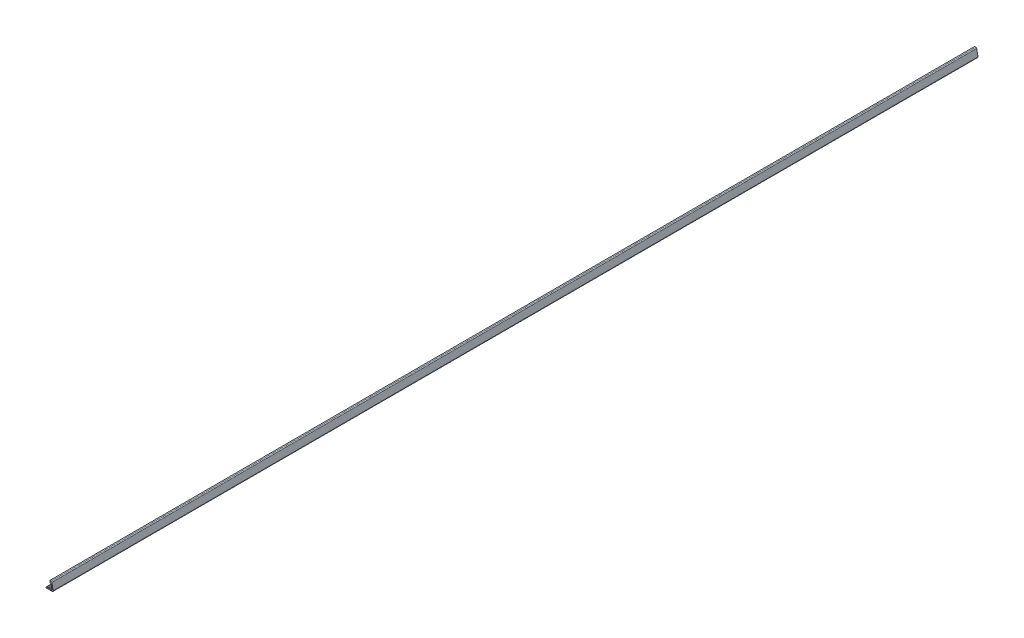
from build123d import *

# Parameters (mm, degrees)
EXTRUDE_1_DEPTH = 1000


with BuildPart() as part:
    # Sketch 2 → Extrude 1 (new body)
    with BuildSketch(Plane.XY):
        with BuildLine():
            Line((3.105809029, 0), (-3.105809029, 0))
            ThreePointArc((-3.105809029, 0), (-3.45936242, 0.146446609), (-3.605809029, 0.5))
            Line((-3.605809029, 0.5), (-3.605809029, 0.548508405))
            ThreePointArc((-3.605809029, 0.548508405), (-3.567748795, 0.739850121), (-3.45936242, 0.902061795))
            Line((-3.45936242, 0.902061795), (-2.561424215, 1.8))
            Line((-2.561424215, 1.8), (-2.361424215, 1))
            Line((-2.361424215, 1), (-1.561424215, 1.8))
            Line((-1.561424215, 1.8), (-1.361424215, 1))
            Line((-1.361424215, 1), (-0.561424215, 1.8))
            Line((-0.561424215, 1.8), (-0.361424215, 1))
            Line((-0.361424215, 1), (0.438575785, 1.8))
            Line((0.438575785, 1.8), (0.638575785, 1))
            Line((0.638575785, 1), (1.438575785, 1.8))
            Line((1.438575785, 1.8), (1.638575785, 1))
            Line((1.638575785, 1), (2.298416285, 1))
            ThreePointArc((2.298416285, 1), (2.683663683, 1.181276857), (2.789565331, 1.593662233))
            Line((2.789565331, 1.593662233), (1.908394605, 6.214373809))
            ThreePointArc((1.908394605, 6.214373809), (1.732145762, 6.491910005), (1.421651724, 6.6))
            Line((1.421651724, 6.6), (0.696296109, 6.6))
            Line((0.696296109, 6.6), (0.496296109, 9))
            Line((0.496296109, 9), (1.760026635, 9))
            ThreePointArc((1.760026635, 9), (2.39689509, 8.770972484), (2.742042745, 8.188797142))
            Line((2.742042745, 8.188797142), (4.087825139, 1.188797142))
            ThreePointArc((4.087825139, 1.188797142), (3.876781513, 0.363131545), (3.105809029, 0))
        make_face()
    extrude(amount=EXTRUDE_1_DEPTH)


solid = part.part
